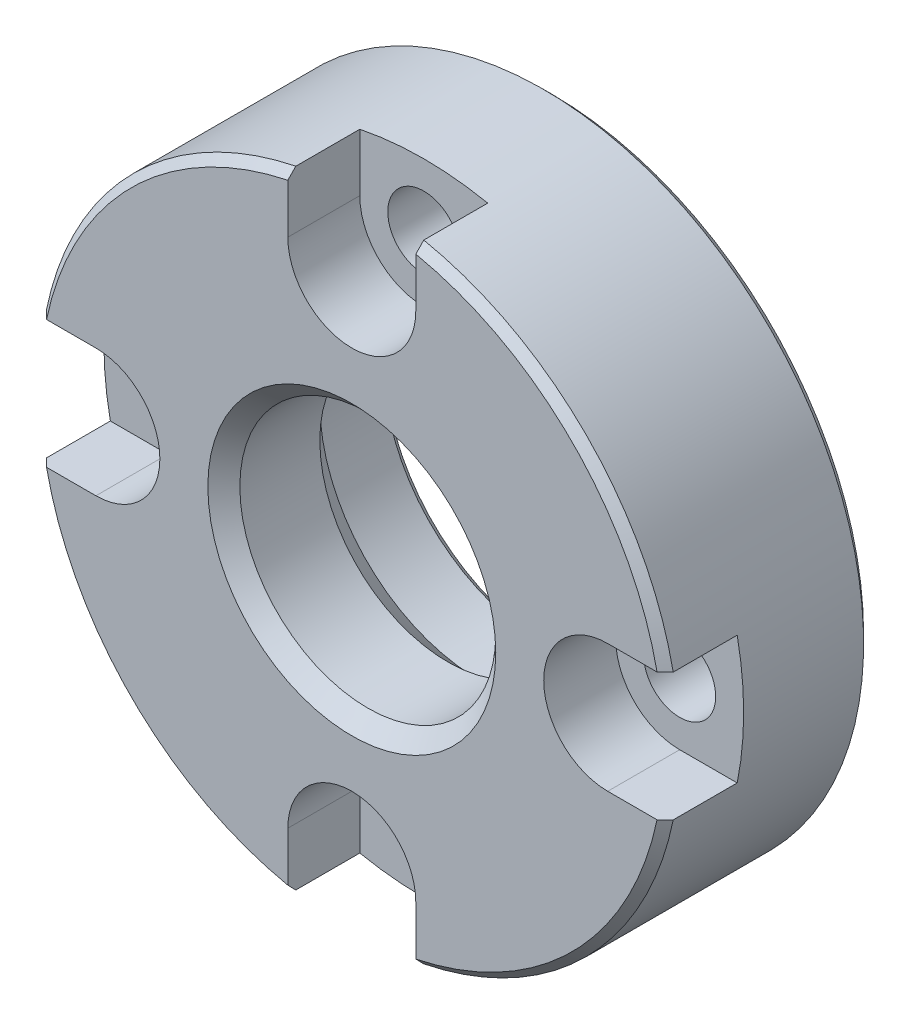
ISO-10303-21;
HEADER;
FILE_DESCRIPTION(('STEP AP214'),'2;1');
FILE_NAME('part.step','',(''),(''),'','','');
FILE_SCHEMA(('AUTOMOTIVE_DESIGN { 1 0 10303 214 1 1 1 1 }'));
ENDSEC;
DATA;
#1=APPLICATION_CONTEXT('core data for automotive mechanical design processes');
#2=APPLICATION_PROTOCOL_DEFINITION('international standard','automotive_design',2000,#1);
#3=PRODUCT_CONTEXT('',#1,'mechanical');
#4=PRODUCT('Part','Part','',(#3));
#5=PRODUCT_RELATED_PRODUCT_CATEGORY('part','',(#4));
#6=PRODUCT_DEFINITION_FORMATION('','',#4);
#7=PRODUCT_DEFINITION_CONTEXT('part definition',#1,'design');
#8=PRODUCT_DEFINITION('design','',#6,#7);
#9=PRODUCT_DEFINITION_SHAPE('','',#8);
#10=(LENGTH_UNIT() NAMED_UNIT(*) SI_UNIT(.MILLI.,.METRE.));
#11=(NAMED_UNIT(*) PLANE_ANGLE_UNIT() SI_UNIT($,.RADIAN.));
#12=(NAMED_UNIT(*) SI_UNIT($,.STERADIAN.) SOLID_ANGLE_UNIT());
#13=UNCERTAINTY_MEASURE_WITH_UNIT(LENGTH_MEASURE(1.E-05),#10,'distance_accuracy_value','');
#14=(GEOMETRIC_REPRESENTATION_CONTEXT(3) GLOBAL_UNCERTAINTY_ASSIGNED_CONTEXT((#13)) GLOBAL_UNIT_ASSIGNED_CONTEXT((#10,
#11,#12)) REPRESENTATION_CONTEXT('',''));
#15=CARTESIAN_POINT('',(0.,0.,0.));
#16=DIRECTION('',(0.,0.,1.));
#17=DIRECTION('',(1.,0.,0.));
#18=AXIS2_PLACEMENT_3D('',#15,#16,#17);
#19=CARTESIAN_POINT('',(-20.,0.,12.5));
#20=DIRECTION('',(0.,0.,1.));
#21=DIRECTION('',(1.,0.,0.));
#22=AXIS2_PLACEMENT_3D('',#19,#20,#21);
#23=PLANE('',#22);
#24=CARTESIAN_POINT('',(0.,0.,12.5));
#25=DIRECTION('',(0.,0.,1.));
#26=DIRECTION('',(1.,0.,0.));
#27=AXIS2_PLACEMENT_3D('',#24,#25,#26);
#28=CIRCLE('',#27,9.);
#29=CARTESIAN_POINT('',(9.,0.,12.5));
#30=VERTEX_POINT('',#29);
#31=EDGE_CURVE('E358',#30,#30,#28,.F.);
#32=ORIENTED_EDGE('',*,*,#31,.T.);
#33=EDGE_LOOP('',(#32));
#34=FACE_BOUND('',#33,.T.);
#35=DIRECTION('',(1.,0.,0.));
#36=VECTOR('',#35,1.);
#37=CARTESIAN_POINT('',(-16.,-4.,12.5));
#38=LINE('',#37,#36);
#39=CARTESIAN_POINT('',(-19.0853346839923,-4.,12.5));
#40=VERTEX_POINT('',#39);
#41=CARTESIAN_POINT('',(-16.,-4.,12.5));
#42=VERTEX_POINT('',#41);
#43=EDGE_CURVE('E260',#40,#42,#38,.T.);
#44=ORIENTED_EDGE('',*,*,#43,.F.);
#45=CARTESIAN_POINT('',(0.,0.,12.5));
#46=DIRECTION('',(0.,0.,1.));
#47=DIRECTION('',(1.,0.,0.));
#48=AXIS2_PLACEMENT_3D('',#45,#46,#47);
#49=CIRCLE('',#48,19.5);
#50=CARTESIAN_POINT('',(-3.99999999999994,-19.0853346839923,12.5));
#51=VERTEX_POINT('',#50);
#52=EDGE_CURVE('E517',#40,#51,#49,.T.);
#53=ORIENTED_EDGE('',*,*,#52,.T.);
#54=DIRECTION('',(0.,-1.,0.));
#55=VECTOR('',#54,1.);
#56=CARTESIAN_POINT('',(-3.99999999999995,-16.,12.5));
#57=LINE('',#56,#55);
#58=CARTESIAN_POINT('',(-3.99999999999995,-16.,12.5));
#59=VERTEX_POINT('',#58);
#60=EDGE_CURVE('E238',#59,#51,#57,.T.);
#61=ORIENTED_EDGE('',*,*,#60,.F.);
#62=CARTESIAN_POINT('',(0.,-16.,12.5));
#63=DIRECTION('',(0.,0.,1.));
#64=DIRECTION('',(0.,1.,0.));
#65=AXIS2_PLACEMENT_3D('',#62,#63,#64);
#66=CIRCLE('',#65,4.);
#67=CARTESIAN_POINT('',(4.00000000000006,-16.,12.5));
#68=VERTEX_POINT('',#67);
#69=EDGE_CURVE('E217',#68,#59,#66,.T.);
#70=ORIENTED_EDGE('',*,*,#69,.F.);
#71=DIRECTION('',(0.,1.,0.));
#72=VECTOR('',#71,1.);
#73=CARTESIAN_POINT('',(4.00000000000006,-16.,12.5));
#74=LINE('',#73,#72);
#75=CARTESIAN_POINT('',(4.00000000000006,-19.0853346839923,12.5));
#76=VERTEX_POINT('',#75);
#77=EDGE_CURVE('E228',#76,#68,#74,.T.);
#78=ORIENTED_EDGE('',*,*,#77,.F.);
#79=CARTESIAN_POINT('',(0.,0.,12.5));
#80=DIRECTION('',(0.,0.,1.));
#81=DIRECTION('',(1.,0.,0.));
#82=AXIS2_PLACEMENT_3D('',#79,#80,#81);
#83=CIRCLE('',#82,19.5);
#84=CARTESIAN_POINT('',(19.0853346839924,-3.99999999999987,12.5));
#85=VERTEX_POINT('',#84);
#86=EDGE_CURVE('E511',#76,#85,#83,.T.);
#87=ORIENTED_EDGE('',*,*,#86,.T.);
#88=DIRECTION('',(1.,0.,0.));
#89=VECTOR('',#88,1.);
#90=CARTESIAN_POINT('',(16.,-3.99999999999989,12.5));
#91=LINE('',#90,#89);
#92=CARTESIAN_POINT('',(16.,-3.99999999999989,12.5));
#93=VERTEX_POINT('',#92);
#94=EDGE_CURVE('E210',#93,#85,#91,.T.);
#95=ORIENTED_EDGE('',*,*,#94,.F.);
#96=CARTESIAN_POINT('',(16.,1.13686837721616E-13,12.5));
#97=DIRECTION('',(0.,0.,1.));
#98=DIRECTION('',(-1.,0.,0.));
#99=AXIS2_PLACEMENT_3D('',#96,#97,#98);
#100=CIRCLE('',#99,4.);
#101=CARTESIAN_POINT('',(16.,4.00000000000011,12.5));
#102=VERTEX_POINT('',#101);
#103=EDGE_CURVE('E191',#102,#93,#100,.T.);
#104=ORIENTED_EDGE('',*,*,#103,.F.);
#105=DIRECTION('',(-1.,0.,0.));
#106=VECTOR('',#105,1.);
#107=CARTESIAN_POINT('',(16.,4.00000000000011,12.5));
#108=LINE('',#107,#106);
#109=CARTESIAN_POINT('',(19.0853346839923,4.00000000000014,12.5));
#110=VERTEX_POINT('',#109);
#111=EDGE_CURVE('E200',#110,#102,#108,.T.);
#112=ORIENTED_EDGE('',*,*,#111,.F.);
#113=CARTESIAN_POINT('',(0.,0.,12.5));
#114=DIRECTION('',(0.,0.,1.));
#115=DIRECTION('',(1.,0.,0.));
#116=AXIS2_PLACEMENT_3D('',#113,#114,#115);
#117=CIRCLE('',#116,19.5);
#118=CARTESIAN_POINT('',(3.9999999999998,19.0853346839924,12.5));
#119=VERTEX_POINT('',#118);
#120=EDGE_CURVE('E31',#110,#119,#117,.T.);
#121=ORIENTED_EDGE('',*,*,#120,.T.);
#122=DIRECTION('',(0.,1.,0.));
#123=VECTOR('',#122,1.);
#124=CARTESIAN_POINT('',(3.99999999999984,16.,12.5));
#125=LINE('',#124,#123);
#126=CARTESIAN_POINT('',(3.99999999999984,16.,12.5));
#127=VERTEX_POINT('',#126);
#128=EDGE_CURVE('E179',#127,#119,#125,.T.);
#129=ORIENTED_EDGE('',*,*,#128,.F.);
#130=CARTESIAN_POINT('',(-1.69550539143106E-13,16.,12.5));
#131=DIRECTION('',(0.,0.,1.));
#132=DIRECTION('',(0.,-1.,0.));
#133=AXIS2_PLACEMENT_3D('',#130,#131,#132);
#134=CIRCLE('',#133,4.);
#135=CARTESIAN_POINT('',(-4.00000000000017,16.,12.5));
#136=VERTEX_POINT('',#135);
#137=EDGE_CURVE('E162',#136,#127,#134,.T.);
#138=ORIENTED_EDGE('',*,*,#137,.F.);
#139=DIRECTION('',(0.,-1.,0.));
#140=VECTOR('',#139,1.);
#141=CARTESIAN_POINT('',(-4.00000000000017,16.,12.5));
#142=LINE('',#141,#140);
#143=CARTESIAN_POINT('',(-4.0000000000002,19.0853346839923,12.5));
#144=VERTEX_POINT('',#143);
#145=EDGE_CURVE('E177',#144,#136,#142,.T.);
#146=ORIENTED_EDGE('',*,*,#145,.F.);
#147=CARTESIAN_POINT('',(0.,0.,12.5));
#148=DIRECTION('',(0.,0.,1.));
#149=DIRECTION('',(1.,0.,0.));
#150=AXIS2_PLACEMENT_3D('',#147,#148,#149);
#151=CIRCLE('',#150,19.5);
#152=CARTESIAN_POINT('',(-19.0853346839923,4.,12.5));
#153=VERTEX_POINT('',#152);
#154=EDGE_CURVE('E328',#144,#153,#151,.T.);
#155=ORIENTED_EDGE('',*,*,#154,.T.);
#156=DIRECTION('',(-1.,0.,0.));
#157=VECTOR('',#156,1.);
#158=CARTESIAN_POINT('',(-16.,4.,12.5));
#159=LINE('',#158,#157);
#160=CARTESIAN_POINT('',(-16.,4.,12.5));
#161=VERTEX_POINT('',#160);
#162=EDGE_CURVE('E270',#161,#153,#159,.T.);
#163=ORIENTED_EDGE('',*,*,#162,.F.);
#164=CARTESIAN_POINT('',(-16.,0.,12.5));
#165=DIRECTION('',(0.,0.,1.));
#166=DIRECTION('',(1.,0.,0.));
#167=AXIS2_PLACEMENT_3D('',#164,#165,#166);
#168=CIRCLE('',#167,4.);
#169=EDGE_CURVE('E255',#42,#161,#168,.T.);
#170=ORIENTED_EDGE('',*,*,#169,.F.);
#171=EDGE_LOOP('',(#44,#53,#61,#70,#78,#87,#95,#104,#112,#121,#129,#138,#146,#155,#163,#170));
#172=FACE_BOUND('',#171,.T.);
#173=ADVANCED_FACE('F16',(#34,#172),#23,.T.);
#174=CARTESIAN_POINT('',(0.,0.,0.));
#175=DIRECTION('',(0.,0.,-1.));
#176=DIRECTION('',(-1.,0.,0.));
#177=AXIS2_PLACEMENT_3D('',#174,#175,#176);
#178=CYLINDRICAL_SURFACE('',#177,20.);
#179=CARTESIAN_POINT('',(0.,0.,0.500000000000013));
#180=DIRECTION('',(0.,0.,-1.));
#181=DIRECTION('',(-1.,0.,0.));
#182=AXIS2_PLACEMENT_3D('',#179,#180,#181);
#183=CIRCLE('',#182,20.);
#184=CARTESIAN_POINT('',(-20.,0.,0.500000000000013));
#185=VERTEX_POINT('',#184);
#186=EDGE_CURVE('E10',#185,#185,#183,.F.);
#187=ORIENTED_EDGE('',*,*,#186,.T.);
#188=EDGE_LOOP('',(#187));
#189=FACE_BOUND('',#188,.T.);
#190=DIRECTION('',(0.,0.,1.));
#191=VECTOR('',#190,1.);
#192=CARTESIAN_POINT('',(-3.99999999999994,-19.5959179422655,8.));
#193=LINE('',#192,#191);
#194=CARTESIAN_POINT('',(-3.99999999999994,-19.5959179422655,8.));
#195=VERTEX_POINT('',#194);
#196=CARTESIAN_POINT('',(-3.99999999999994,-19.5959179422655,12.));
#197=VERTEX_POINT('',#196);
#198=EDGE_CURVE('E249',#195,#197,#193,.T.);
#199=ORIENTED_EDGE('',*,*,#198,.T.);
#200=CARTESIAN_POINT('',(0.,0.,12.));
#201=DIRECTION('',(0.,0.,1.));
#202=DIRECTION('',(1.,0.,0.));
#203=AXIS2_PLACEMENT_3D('',#200,#201,#202);
#204=CIRCLE('',#203,20.);
#205=CARTESIAN_POINT('',(-19.5959179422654,-4.,12.));
#206=VERTEX_POINT('',#205);
#207=EDGE_CURVE('E317',#197,#206,#204,.F.);
#208=ORIENTED_EDGE('',*,*,#207,.T.);
#209=DIRECTION('',(0.,0.,1.));
#210=VECTOR('',#209,1.);
#211=CARTESIAN_POINT('',(-19.5959179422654,-4.,8.));
#212=LINE('',#211,#210);
#213=CARTESIAN_POINT('',(-19.5959179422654,-4.,8.));
#214=VERTEX_POINT('',#213);
#215=EDGE_CURVE('E278',#214,#206,#212,.T.);
#216=ORIENTED_EDGE('',*,*,#215,.F.);
#217=CARTESIAN_POINT('',(0.,0.,8.));
#218=DIRECTION('',(0.,0.,1.));
#219=DIRECTION('',(1.,0.,0.));
#220=AXIS2_PLACEMENT_3D('',#217,#218,#219);
#221=CIRCLE('',#220,20.);
#222=CARTESIAN_POINT('',(-19.5959179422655,4.,8.));
#223=VERTEX_POINT('',#222);
#224=EDGE_CURVE('E262',#223,#214,#221,.T.);
#225=ORIENTED_EDGE('',*,*,#224,.F.);
#226=DIRECTION('',(0.,0.,1.));
#227=VECTOR('',#226,1.);
#228=CARTESIAN_POINT('',(-19.5959179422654,4.,8.));
#229=LINE('',#228,#227);
#230=CARTESIAN_POINT('',(-19.5959179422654,4.,12.));
#231=VERTEX_POINT('',#230);
#232=EDGE_CURVE('E281',#223,#231,#229,.T.);
#233=ORIENTED_EDGE('',*,*,#232,.T.);
#234=CARTESIAN_POINT('',(0.,0.,12.));
#235=DIRECTION('',(0.,0.,1.));
#236=DIRECTION('',(1.,0.,0.));
#237=AXIS2_PLACEMENT_3D('',#234,#235,#236);
#238=CIRCLE('',#237,20.);
#239=CARTESIAN_POINT('',(-4.00000000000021,19.5959179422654,12.));
#240=VERTEX_POINT('',#239);
#241=EDGE_CURVE('E308',#231,#240,#238,.F.);
#242=ORIENTED_EDGE('',*,*,#241,.T.);
#243=DIRECTION('',(0.,0.,1.));
#244=VECTOR('',#243,1.);
#245=CARTESIAN_POINT('',(-4.00000000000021,19.5959179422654,8.));
#246=LINE('',#245,#244);
#247=CARTESIAN_POINT('',(-4.00000000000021,19.5959179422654,8.));
#248=VERTEX_POINT('',#247);
#249=EDGE_CURVE('E192',#248,#240,#246,.T.);
#250=ORIENTED_EDGE('',*,*,#249,.F.);
#251=CARTESIAN_POINT('',(0.,0.,8.));
#252=DIRECTION('',(0.,0.,1.));
#253=DIRECTION('',(0.,-1.,0.));
#254=AXIS2_PLACEMENT_3D('',#251,#252,#253);
#255=CIRCLE('',#254,20.);
#256=CARTESIAN_POINT('',(3.9999999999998,19.5959179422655,8.));
#257=VERTEX_POINT('',#256);
#258=EDGE_CURVE('E173',#257,#248,#255,.T.);
#259=ORIENTED_EDGE('',*,*,#258,.F.);
#260=DIRECTION('',(0.,0.,1.));
#261=VECTOR('',#260,1.);
#262=CARTESIAN_POINT('',(3.9999999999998,19.5959179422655,8.));
#263=LINE('',#262,#261);
#264=CARTESIAN_POINT('',(3.9999999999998,19.5959179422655,12.));
#265=VERTEX_POINT('',#264);
#266=EDGE_CURVE('E164',#257,#265,#263,.T.);
#267=ORIENTED_EDGE('',*,*,#266,.T.);
#268=CARTESIAN_POINT('',(0.,0.,12.));
#269=DIRECTION('',(0.,0.,1.));
#270=DIRECTION('',(1.,0.,0.));
#271=AXIS2_PLACEMENT_3D('',#268,#269,#270);
#272=CIRCLE('',#271,20.);
#273=CARTESIAN_POINT('',(19.5959179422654,4.00000000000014,12.));
#274=VERTEX_POINT('',#273);
#275=EDGE_CURVE('E311',#265,#274,#272,.F.);
#276=ORIENTED_EDGE('',*,*,#275,.T.);
#277=DIRECTION('',(0.,0.,1.));
#278=VECTOR('',#277,1.);
#279=CARTESIAN_POINT('',(19.5959179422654,4.00000000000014,8.));
#280=LINE('',#279,#278);
#281=CARTESIAN_POINT('',(19.5959179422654,4.00000000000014,8.));
#282=VERTEX_POINT('',#281);
#283=EDGE_CURVE('E218',#282,#274,#280,.T.);
#284=ORIENTED_EDGE('',*,*,#283,.F.);
#285=CARTESIAN_POINT('',(0.,0.,8.));
#286=DIRECTION('',(0.,0.,1.));
#287=DIRECTION('',(-1.,0.,0.));
#288=AXIS2_PLACEMENT_3D('',#285,#286,#287);
#289=CIRCLE('',#288,20.);
#290=CARTESIAN_POINT('',(19.5959179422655,-3.99999999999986,8.));
#291=VERTEX_POINT('',#290);
#292=EDGE_CURVE('E202',#291,#282,#289,.T.);
#293=ORIENTED_EDGE('',*,*,#292,.F.);
#294=DIRECTION('',(0.,0.,1.));
#295=VECTOR('',#294,1.);
#296=CARTESIAN_POINT('',(19.5959179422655,-3.99999999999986,8.));
#297=LINE('',#296,#295);
#298=CARTESIAN_POINT('',(19.5959179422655,-3.99999999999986,12.));
#299=VERTEX_POINT('',#298);
#300=EDGE_CURVE('E220',#291,#299,#297,.T.);
#301=ORIENTED_EDGE('',*,*,#300,.T.);
#302=CARTESIAN_POINT('',(0.,0.,12.));
#303=DIRECTION('',(0.,0.,1.));
#304=DIRECTION('',(1.,0.,0.));
#305=AXIS2_PLACEMENT_3D('',#302,#303,#304);
#306=CIRCLE('',#305,20.);
#307=CARTESIAN_POINT('',(4.00000000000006,-19.5959179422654,12.));
#308=VERTEX_POINT('',#307);
#309=EDGE_CURVE('E314',#299,#308,#306,.F.);
#310=ORIENTED_EDGE('',*,*,#309,.T.);
#311=DIRECTION('',(0.,0.,1.));
#312=VECTOR('',#311,1.);
#313=CARTESIAN_POINT('',(4.00000000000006,-19.5959179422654,8.));
#314=LINE('',#313,#312);
#315=CARTESIAN_POINT('',(4.00000000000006,-19.5959179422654,8.));
#316=VERTEX_POINT('',#315);
#317=EDGE_CURVE('E246',#316,#308,#314,.T.);
#318=ORIENTED_EDGE('',*,*,#317,.F.);
#319=CARTESIAN_POINT('',(0.,0.,8.));
#320=DIRECTION('',(0.,0.,1.));
#321=DIRECTION('',(0.,1.,0.));
#322=AXIS2_PLACEMENT_3D('',#319,#320,#321);
#323=CIRCLE('',#322,20.);
#324=EDGE_CURVE('E230',#195,#316,#323,.T.);
#325=ORIENTED_EDGE('',*,*,#324,.F.);
#326=EDGE_LOOP('',(#199,#208,#216,#225,#233,#242,#250,#259,#267,#276,#284,#293,#301,#310,#318,#325));
#327=FACE_BOUND('',#326,.T.);
#328=ADVANCED_FACE('F393',(#189,#327),#178,.T.);
#329=CARTESIAN_POINT('',(-20.,0.,0.));
#330=DIRECTION('',(0.,0.,-1.));
#331=DIRECTION('',(-1.,0.,0.));
#332=AXIS2_PLACEMENT_3D('',#329,#330,#331);
#333=PLANE('',#332);
#334=CARTESIAN_POINT('',(0.,0.,0.));
#335=DIRECTION('',(0.,0.,-1.));
#336=DIRECTION('',(-1.,0.,0.));
#337=AXIS2_PLACEMENT_3D('',#334,#335,#336);
#338=CIRCLE('',#337,19.5);
#339=CARTESIAN_POINT('',(-19.5,0.,0.));
#340=VERTEX_POINT('',#339);
#341=EDGE_CURVE('E24',#340,#340,#338,.T.);
#342=ORIENTED_EDGE('',*,*,#341,.T.);
#343=EDGE_LOOP('',(#342));
#344=FACE_BOUND('',#343,.T.);
#345=CARTESIAN_POINT('',(0.,0.,0.));
#346=DIRECTION('',(0.,0.,-1.));
#347=DIRECTION('',(-1.,0.,0.));
#348=AXIS2_PLACEMENT_3D('',#345,#346,#347);
#349=CIRCLE('',#348,10.5);
#350=CARTESIAN_POINT('',(-10.5,0.,0.));
#351=VERTEX_POINT('',#350);
#352=EDGE_CURVE('E453',#351,#351,#349,.F.);
#353=ORIENTED_EDGE('',*,*,#352,.T.);
#354=EDGE_LOOP('',(#353));
#355=FACE_BOUND('',#354,.T.);
#356=CARTESIAN_POINT('',(-1.69550539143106E-13,16.,0.));
#357=DIRECTION('',(0.,0.,-1.));
#358=DIRECTION('',(-1.,0.,0.));
#359=AXIS2_PLACEMENT_3D('',#356,#357,#358);
#360=CIRCLE('',#359,2.75);
#361=CARTESIAN_POINT('',(-2.75000000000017,16.,0.));
#362=VERTEX_POINT('',#361);
#363=EDGE_CURVE('E302',#362,#362,#360,.F.);
#364=ORIENTED_EDGE('',*,*,#363,.T.);
#365=EDGE_LOOP('',(#364));
#366=FACE_BOUND('',#365,.T.);
#367=CARTESIAN_POINT('',(16.,1.13686837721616E-13,0.));
#368=DIRECTION('',(0.,0.,-1.));
#369=DIRECTION('',(-1.,0.,0.));
#370=AXIS2_PLACEMENT_3D('',#367,#368,#369);
#371=CIRCLE('',#370,2.75);
#372=CARTESIAN_POINT('',(13.25,1.13686837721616E-13,0.));
#373=VERTEX_POINT('',#372);
#374=EDGE_CURVE('E296',#373,#373,#371,.F.);
#375=ORIENTED_EDGE('',*,*,#374,.T.);
#376=EDGE_LOOP('',(#375));
#377=FACE_BOUND('',#376,.T.);
#378=CARTESIAN_POINT('',(0.,-16.,0.));
#379=DIRECTION('',(0.,0.,-1.));
#380=DIRECTION('',(-1.,0.,0.));
#381=AXIS2_PLACEMENT_3D('',#378,#379,#380);
#382=CIRCLE('',#381,2.75);
#383=CARTESIAN_POINT('',(-2.74999999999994,-16.,0.));
#384=VERTEX_POINT('',#383);
#385=EDGE_CURVE('E290',#384,#384,#382,.F.);
#386=ORIENTED_EDGE('',*,*,#385,.T.);
#387=EDGE_LOOP('',(#386));
#388=FACE_BOUND('',#387,.T.);
#389=CARTESIAN_POINT('',(-16.,0.,0.));
#390=DIRECTION('',(0.,0.,-1.));
#391=DIRECTION('',(-1.,0.,0.));
#392=AXIS2_PLACEMENT_3D('',#389,#390,#391);
#393=CIRCLE('',#392,2.75);
#394=CARTESIAN_POINT('',(-18.75,0.,0.));
#395=VERTEX_POINT('',#394);
#396=EDGE_CURVE('E277',#395,#395,#393,.F.);
#397=ORIENTED_EDGE('',*,*,#396,.T.);
#398=EDGE_LOOP('',(#397));
#399=FACE_BOUND('',#398,.T.);
#400=ADVANCED_FACE('F400',(#344,#355,#366,#377,#388,#399),#333,.T.);
#401=CARTESIAN_POINT('',(-16.,0.,8.));
#402=DIRECTION('',(0.,0.,1.));
#403=DIRECTION('',(1.,0.,0.));
#404=AXIS2_PLACEMENT_3D('',#401,#402,#403);
#405=CYLINDRICAL_SURFACE('',#404,4.);
#406=ORIENTED_EDGE('',*,*,#169,.T.);
#407=DIRECTION('',(0.,0.,1.));
#408=VECTOR('',#407,1.);
#409=CARTESIAN_POINT('',(-16.,4.,8.));
#410=LINE('',#409,#408);
#411=CARTESIAN_POINT('',(-16.,4.,8.));
#412=VERTEX_POINT('',#411);
#413=EDGE_CURVE('E267',#412,#161,#410,.T.);
#414=ORIENTED_EDGE('',*,*,#413,.F.);
#415=CARTESIAN_POINT('',(-16.,0.,8.));
#416=DIRECTION('',(0.,0.,1.));
#417=DIRECTION('',(1.,0.,0.));
#418=AXIS2_PLACEMENT_3D('',#415,#416,#417);
#419=CIRCLE('',#418,4.);
#420=CARTESIAN_POINT('',(-16.,-4.,8.));
#421=VERTEX_POINT('',#420);
#422=EDGE_CURVE('E256',#421,#412,#419,.T.);
#423=ORIENTED_EDGE('',*,*,#422,.F.);
#424=DIRECTION('',(0.,0.,1.));
#425=VECTOR('',#424,1.);
#426=CARTESIAN_POINT('',(-16.,-4.,8.));
#427=LINE('',#426,#425);
#428=EDGE_CURVE('E274',#421,#42,#427,.T.);
#429=ORIENTED_EDGE('',*,*,#428,.T.);
#430=EDGE_LOOP('',(#406,#414,#423,#429));
#431=FACE_BOUND('',#430,.T.);
#432=ADVANCED_FACE('F340',(#431),#405,.F.);
#433=CARTESIAN_POINT('',(-16.,-4.,8.));
#434=DIRECTION('',(0.,-1.,0.));
#435=DIRECTION('',(1.,0.,0.));
#436=AXIS2_PLACEMENT_3D('',#433,#434,#435);
#437=PLANE('',#436);
#438=ORIENTED_EDGE('',*,*,#215,.T.);
#439=CARTESIAN_POINT('',(-19.5959179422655,-4.,12.));
#440=CARTESIAN_POINT('',(-19.5108432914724,-4.,12.0833563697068));
#441=CARTESIAN_POINT('',(-19.4257573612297,-4.,12.1667012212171));
#442=CARTESIAN_POINT('',(-19.2555629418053,-4.,12.3333678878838));
#443=CARTESIAN_POINT('',(-19.1704544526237,-4.,12.4166897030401));
#444=CARTESIAN_POINT('',(-19.0853346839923,-4.,12.5));
#445=B_SPLINE_CURVE_WITH_KNOTS('',3,(#439,#440,#441,#442,#443,#444),.UNSPECIFIED.,.F.,.F.,(4,2,
4),(0.,0.357314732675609,0.71462946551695),.UNSPECIFIED.);
#446=EDGE_CURVE('E320',#206,#40,#445,.T.);
#447=ORIENTED_EDGE('',*,*,#446,.T.);
#448=ORIENTED_EDGE('',*,*,#43,.T.);
#449=ORIENTED_EDGE('',*,*,#428,.F.);
#450=DIRECTION('',(1.,0.,0.));
#451=VECTOR('',#450,1.);
#452=CARTESIAN_POINT('',(-16.,-4.,8.));
#453=LINE('',#452,#451);
#454=EDGE_CURVE('E264',#214,#421,#453,.T.);
#455=ORIENTED_EDGE('',*,*,#454,.F.);
#456=EDGE_LOOP('',(#438,#447,#448,#449,#455));
#457=FACE_BOUND('',#456,.T.);
#458=ADVANCED_FACE('F334',(#457),#437,.F.);
#459=CARTESIAN_POINT('',(-16.,4.,8.));
#460=DIRECTION('',(0.,1.,0.));
#461=DIRECTION('',(-1.,0.,0.));
#462=AXIS2_PLACEMENT_3D('',#459,#460,#461);
#463=PLANE('',#462);
#464=ORIENTED_EDGE('',*,*,#162,.T.);
#465=CARTESIAN_POINT('',(-19.0853346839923,4.,12.5));
#466=CARTESIAN_POINT('',(-19.1704544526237,4.,12.4166897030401));
#467=CARTESIAN_POINT('',(-19.2555629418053,4.,12.3333678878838));
#468=CARTESIAN_POINT('',(-19.4257573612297,4.,12.1667012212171));
#469=CARTESIAN_POINT('',(-19.5108432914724,4.,12.0833563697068));
#470=CARTESIAN_POINT('',(-19.5959179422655,4.,12.));
#471=B_SPLINE_CURVE_WITH_KNOTS('',3,(#465,#466,#467,#468,#469,#470),.UNSPECIFIED.,.F.,.F.,(4,2,
4),(0.,0.35731473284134,0.71462946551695),.UNSPECIFIED.);
#472=EDGE_CURVE('E350',#153,#231,#471,.T.);
#473=ORIENTED_EDGE('',*,*,#472,.T.);
#474=ORIENTED_EDGE('',*,*,#232,.F.);
#475=DIRECTION('',(-1.,0.,0.));
#476=VECTOR('',#475,1.);
#477=CARTESIAN_POINT('',(-16.,4.,8.));
#478=LINE('',#477,#476);
#479=EDGE_CURVE('E259',#412,#223,#478,.T.);
#480=ORIENTED_EDGE('',*,*,#479,.F.);
#481=ORIENTED_EDGE('',*,*,#413,.T.);
#482=EDGE_LOOP('',(#464,#473,#474,#480,#481));
#483=FACE_BOUND('',#482,.T.);
#484=ADVANCED_FACE('F339',(#483),#463,.F.);
#485=CARTESIAN_POINT('',(-16.,0.,8.));
#486=DIRECTION('',(0.,0.,1.));
#487=DIRECTION('',(1.,0.,0.));
#488=AXIS2_PLACEMENT_3D('',#485,#486,#487);
#489=PLANE('',#488);
#490=CARTESIAN_POINT('',(-16.,0.,8.));
#491=DIRECTION('',(0.,0.,1.));
#492=DIRECTION('',(1.,0.,0.));
#493=AXIS2_PLACEMENT_3D('',#490,#491,#492);
#494=CIRCLE('',#493,2.25);
#495=CARTESIAN_POINT('',(-13.75,0.,8.));
#496=VERTEX_POINT('',#495);
#497=EDGE_CURVE('E245',#496,#496,#494,.T.);
#498=ORIENTED_EDGE('',*,*,#497,.F.);
#499=EDGE_LOOP('',(#498));
#500=FACE_BOUND('',#499,.T.);
#501=ORIENTED_EDGE('',*,*,#422,.T.);
#502=ORIENTED_EDGE('',*,*,#479,.T.);
#503=ORIENTED_EDGE('',*,*,#224,.T.);
#504=ORIENTED_EDGE('',*,*,#454,.T.);
#505=EDGE_LOOP('',(#501,#502,#503,#504));
#506=FACE_BOUND('',#505,.T.);
#507=ADVANCED_FACE('F342',(#500,#506),#489,.T.);
#508=CARTESIAN_POINT('',(-16.,0.,0.));
#509=DIRECTION('',(0.,0.,1.));
#510=DIRECTION('',(1.,0.,0.));
#511=AXIS2_PLACEMENT_3D('',#508,#509,#510);
#512=CYLINDRICAL_SURFACE('',#511,2.25);
#513=CARTESIAN_POINT('',(-16.,0.,0.5));
#514=DIRECTION('',(0.,0.,-1.));
#515=DIRECTION('',(-1.,0.,0.));
#516=AXIS2_PLACEMENT_3D('',#513,#514,#515);
#517=CIRCLE('',#516,2.25);
#518=CARTESIAN_POINT('',(-18.25,0.,0.5));
#519=VERTEX_POINT('',#518);
#520=EDGE_CURVE('E287',#519,#519,#517,.T.);
#521=ORIENTED_EDGE('',*,*,#520,.T.);
#522=EDGE_LOOP('',(#521));
#523=FACE_BOUND('',#522,.T.);
#524=ORIENTED_EDGE('',*,*,#497,.T.);
#525=EDGE_LOOP('',(#524));
#526=FACE_BOUND('',#525,.T.);
#527=ADVANCED_FACE('F409',(#523,#526),#512,.F.);
#528=CARTESIAN_POINT('',(-16.,0.,0.));
#529=DIRECTION('',(0.,0.,-1.));
#530=DIRECTION('',(-1.,0.,0.));
#531=AXIS2_PLACEMENT_3D('',#528,#529,#530);
#532=CONICAL_SURFACE('',#531,2.75,0.785398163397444);
#533=ORIENTED_EDGE('',*,*,#520,.F.);
#534=EDGE_LOOP('',(#533));
#535=FACE_BOUND('',#534,.T.);
#536=ORIENTED_EDGE('',*,*,#396,.F.);
#537=EDGE_LOOP('',(#536));
#538=FACE_BOUND('',#537,.T.);
#539=ADVANCED_FACE('F405',(#535,#538),#532,.F.);
#540=CARTESIAN_POINT('',(0.,-16.,8.));
#541=DIRECTION('',(0.,0.,1.));
#542=DIRECTION('',(1.,0.,0.));
#543=AXIS2_PLACEMENT_3D('',#540,#541,#542);
#544=CYLINDRICAL_SURFACE('',#543,4.);
#545=ORIENTED_EDGE('',*,*,#69,.T.);
#546=DIRECTION('',(0.,0.,1.));
#547=VECTOR('',#546,1.);
#548=CARTESIAN_POINT('',(-3.99999999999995,-16.,8.));
#549=LINE('',#548,#547);
#550=CARTESIAN_POINT('',(-3.99999999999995,-16.,8.));
#551=VERTEX_POINT('',#550);
#552=EDGE_CURVE('E235',#551,#59,#549,.T.);
#553=ORIENTED_EDGE('',*,*,#552,.F.);
#554=CARTESIAN_POINT('',(0.,-16.,8.));
#555=DIRECTION('',(0.,0.,1.));
#556=DIRECTION('',(0.,1.,0.));
#557=AXIS2_PLACEMENT_3D('',#554,#555,#556);
#558=CIRCLE('',#557,4.);
#559=CARTESIAN_POINT('',(4.00000000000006,-16.,8.));
#560=VERTEX_POINT('',#559);
#561=EDGE_CURVE('E224',#560,#551,#558,.T.);
#562=ORIENTED_EDGE('',*,*,#561,.F.);
#563=DIRECTION('',(0.,0.,1.));
#564=VECTOR('',#563,1.);
#565=CARTESIAN_POINT('',(4.00000000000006,-16.,8.));
#566=LINE('',#565,#564);
#567=EDGE_CURVE('E242',#560,#68,#566,.T.);
#568=ORIENTED_EDGE('',*,*,#567,.T.);
#569=EDGE_LOOP('',(#545,#553,#562,#568));
#570=FACE_BOUND('',#569,.T.);
#571=ADVANCED_FACE('F408',(#570),#544,.F.);
#572=CARTESIAN_POINT('',(4.00000000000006,-16.,8.));
#573=DIRECTION('',(1.,0.,0.));
#574=DIRECTION('',(0.,1.,0.));
#575=AXIS2_PLACEMENT_3D('',#572,#573,#574);
#576=PLANE('',#575);
#577=ORIENTED_EDGE('',*,*,#317,.T.);
#578=CARTESIAN_POINT('',(4.00000000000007,-19.5959179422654,12.));
#579=CARTESIAN_POINT('',(4.00000000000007,-19.5108432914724,12.0833563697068));
#580=CARTESIAN_POINT('',(4.00000000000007,-19.4257573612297,12.1667012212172));
#581=CARTESIAN_POINT('',(4.00000000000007,-19.2555629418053,12.3333678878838));
#582=CARTESIAN_POINT('',(4.00000000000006,-19.1704544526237,12.4166897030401));
#583=CARTESIAN_POINT('',(4.00000000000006,-19.0853346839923,12.5));
#584=B_SPLINE_CURVE_WITH_KNOTS('',3,(#578,#579,#580,#581,#582,#583),.UNSPECIFIED.,.F.,.F.,(4,2,
4),(0.,0.357314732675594,0.714629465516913),.UNSPECIFIED.);
#585=EDGE_CURVE('E507',#308,#76,#584,.T.);
#586=ORIENTED_EDGE('',*,*,#585,.T.);
#587=ORIENTED_EDGE('',*,*,#77,.T.);
#588=ORIENTED_EDGE('',*,*,#567,.F.);
#589=DIRECTION('',(0.,1.,0.));
#590=VECTOR('',#589,1.);
#591=CARTESIAN_POINT('',(4.00000000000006,-16.,8.));
#592=LINE('',#591,#590);
#593=EDGE_CURVE('E232',#316,#560,#592,.T.);
#594=ORIENTED_EDGE('',*,*,#593,.F.);
#595=EDGE_LOOP('',(#577,#586,#587,#588,#594));
#596=FACE_BOUND('',#595,.T.);
#597=ADVANCED_FACE('F505',(#596),#576,.F.);
#598=CARTESIAN_POINT('',(-3.99999999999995,-16.,8.));
#599=DIRECTION('',(-1.,0.,0.));
#600=DIRECTION('',(0.,-1.,0.));
#601=AXIS2_PLACEMENT_3D('',#598,#599,#600);
#602=PLANE('',#601);
#603=ORIENTED_EDGE('',*,*,#60,.T.);
#604=CARTESIAN_POINT('',(-3.99999999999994,-19.0853346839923,12.5));
#605=CARTESIAN_POINT('',(-3.99999999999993,-19.1704544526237,12.4166897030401));
#606=CARTESIAN_POINT('',(-3.99999999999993,-19.2555629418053,12.3333678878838));
#607=CARTESIAN_POINT('',(-3.99999999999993,-19.4257573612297,12.1667012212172));
#608=CARTESIAN_POINT('',(-3.99999999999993,-19.5108432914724,12.0833563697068));
#609=CARTESIAN_POINT('',(-3.99999999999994,-19.5959179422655,12.));
#610=B_SPLINE_CURVE_WITH_KNOTS('',3,(#604,#605,#606,#607,#608,#609),.UNSPECIFIED.,.F.,.F.,(4,2,
4),(0.,0.35731473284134,0.71462946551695),.UNSPECIFIED.);
#611=EDGE_CURVE('E500',#51,#197,#610,.T.);
#612=ORIENTED_EDGE('',*,*,#611,.T.);
#613=ORIENTED_EDGE('',*,*,#198,.F.);
#614=DIRECTION('',(0.,-1.,0.));
#615=VECTOR('',#614,1.);
#616=CARTESIAN_POINT('',(-3.99999999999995,-16.,8.));
#617=LINE('',#616,#615);
#618=EDGE_CURVE('E227',#551,#195,#617,.T.);
#619=ORIENTED_EDGE('',*,*,#618,.F.);
#620=ORIENTED_EDGE('',*,*,#552,.T.);
#621=EDGE_LOOP('',(#603,#612,#613,#619,#620));
#622=FACE_BOUND('',#621,.T.);
#623=ADVANCED_FACE('F488',(#622),#602,.F.);
#624=CARTESIAN_POINT('',(0.,-16.,8.));
#625=DIRECTION('',(0.,0.,1.));
#626=DIRECTION('',(0.,1.,0.));
#627=AXIS2_PLACEMENT_3D('',#624,#625,#626);
#628=PLANE('',#627);
#629=CARTESIAN_POINT('',(0.,-16.,8.));
#630=DIRECTION('',(0.,0.,1.));
#631=DIRECTION('',(0.,1.,0.));
#632=AXIS2_PLACEMENT_3D('',#629,#630,#631);
#633=CIRCLE('',#632,2.25);
#634=CARTESIAN_POINT('',(0.,-13.75,8.));
#635=VERTEX_POINT('',#634);
#636=EDGE_CURVE('E182',#635,#635,#633,.T.);
#637=ORIENTED_EDGE('',*,*,#636,.F.);
#638=EDGE_LOOP('',(#637));
#639=FACE_BOUND('',#638,.T.);
#640=ORIENTED_EDGE('',*,*,#561,.T.);
#641=ORIENTED_EDGE('',*,*,#618,.T.);
#642=ORIENTED_EDGE('',*,*,#324,.T.);
#643=ORIENTED_EDGE('',*,*,#593,.T.);
#644=EDGE_LOOP('',(#640,#641,#642,#643));
#645=FACE_BOUND('',#644,.T.);
#646=ADVANCED_FACE('F484',(#639,#645),#628,.T.);
#647=CARTESIAN_POINT('',(16.,1.13686837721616E-13,8.));
#648=DIRECTION('',(0.,0.,1.));
#649=DIRECTION('',(1.,0.,0.));
#650=AXIS2_PLACEMENT_3D('',#647,#648,#649);
#651=CYLINDRICAL_SURFACE('',#650,4.);
#652=ORIENTED_EDGE('',*,*,#103,.T.);
#653=DIRECTION('',(0.,0.,1.));
#654=VECTOR('',#653,1.);
#655=CARTESIAN_POINT('',(16.,-3.99999999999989,8.));
#656=LINE('',#655,#654);
#657=CARTESIAN_POINT('',(16.,-3.99999999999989,8.));
#658=VERTEX_POINT('',#657);
#659=EDGE_CURVE('E207',#658,#93,#656,.T.);
#660=ORIENTED_EDGE('',*,*,#659,.F.);
#661=CARTESIAN_POINT('',(16.,1.13686837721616E-13,8.));
#662=DIRECTION('',(0.,0.,1.));
#663=DIRECTION('',(-1.,0.,0.));
#664=AXIS2_PLACEMENT_3D('',#661,#662,#663);
#665=CIRCLE('',#664,4.);
#666=CARTESIAN_POINT('',(16.,4.00000000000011,8.));
#667=VERTEX_POINT('',#666);
#668=EDGE_CURVE('E196',#667,#658,#665,.T.);
#669=ORIENTED_EDGE('',*,*,#668,.F.);
#670=DIRECTION('',(0.,0.,1.));
#671=VECTOR('',#670,1.);
#672=CARTESIAN_POINT('',(16.,4.00000000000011,8.));
#673=LINE('',#672,#671);
#674=EDGE_CURVE('E214',#667,#102,#673,.T.);
#675=ORIENTED_EDGE('',*,*,#674,.T.);
#676=EDGE_LOOP('',(#652,#660,#669,#675));
#677=FACE_BOUND('',#676,.T.);
#678=ADVANCED_FACE('F487',(#677),#651,.F.);
#679=CARTESIAN_POINT('',(16.,4.00000000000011,8.));
#680=DIRECTION('',(0.,1.,0.));
#681=DIRECTION('',(-1.,0.,0.));
#682=AXIS2_PLACEMENT_3D('',#679,#680,#681);
#683=PLANE('',#682);
#684=ORIENTED_EDGE('',*,*,#283,.T.);
#685=CARTESIAN_POINT('',(19.5959179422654,4.00000000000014,12.));
#686=CARTESIAN_POINT('',(19.5108432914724,4.00000000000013,12.0833563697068));
#687=CARTESIAN_POINT('',(19.4257573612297,4.00000000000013,12.1667012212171));
#688=CARTESIAN_POINT('',(19.2555629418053,4.00000000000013,12.3333678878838));
#689=CARTESIAN_POINT('',(19.1704544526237,4.00000000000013,12.4166897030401));
#690=CARTESIAN_POINT('',(19.0853346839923,4.00000000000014,12.5));
#691=B_SPLINE_CURVE_WITH_KNOTS('',3,(#685,#686,#687,#688,#689,#690),.UNSPECIFIED.,.F.,.F.,(4,2,
4),(0.,0.357314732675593,0.714629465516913),.UNSPECIFIED.);
#692=EDGE_CURVE('E39',#274,#110,#691,.T.);
#693=ORIENTED_EDGE('',*,*,#692,.T.);
#694=ORIENTED_EDGE('',*,*,#111,.T.);
#695=ORIENTED_EDGE('',*,*,#674,.F.);
#696=DIRECTION('',(-1.,0.,0.));
#697=VECTOR('',#696,1.);
#698=CARTESIAN_POINT('',(16.,4.00000000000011,8.));
#699=LINE('',#698,#697);
#700=EDGE_CURVE('E204',#282,#667,#699,.T.);
#701=ORIENTED_EDGE('',*,*,#700,.F.);
#702=EDGE_LOOP('',(#684,#693,#694,#695,#701));
#703=FACE_BOUND('',#702,.T.);
#704=ADVANCED_FACE('F589',(#703),#683,.F.);
#705=CARTESIAN_POINT('',(16.,-3.99999999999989,8.));
#706=DIRECTION('',(0.,-1.,0.));
#707=DIRECTION('',(1.,0.,0.));
#708=AXIS2_PLACEMENT_3D('',#705,#706,#707);
#709=PLANE('',#708);
#710=ORIENTED_EDGE('',*,*,#94,.T.);
#711=CARTESIAN_POINT('',(19.0853346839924,-3.99999999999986,12.5));
#712=CARTESIAN_POINT('',(19.1704544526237,-3.99999999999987,12.4166897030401));
#713=CARTESIAN_POINT('',(19.2555629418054,-3.99999999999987,12.3333678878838));
#714=CARTESIAN_POINT('',(19.4257573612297,-3.99999999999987,12.1667012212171));
#715=CARTESIAN_POINT('',(19.5108432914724,-3.99999999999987,12.0833563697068));
#716=CARTESIAN_POINT('',(19.5959179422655,-3.99999999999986,12.));
#717=B_SPLINE_CURVE_WITH_KNOTS('',3,(#711,#712,#713,#714,#715,#716),.UNSPECIFIED.,.F.,.F.,(4,2,
4),(0.,0.357314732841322,0.714629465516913),.UNSPECIFIED.);
#718=EDGE_CURVE('E516',#85,#299,#717,.T.);
#719=ORIENTED_EDGE('',*,*,#718,.T.);
#720=ORIENTED_EDGE('',*,*,#300,.F.);
#721=DIRECTION('',(1.,0.,0.));
#722=VECTOR('',#721,1.);
#723=CARTESIAN_POINT('',(16.,-3.99999999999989,8.));
#724=LINE('',#723,#722);
#725=EDGE_CURVE('E199',#658,#291,#724,.T.);
#726=ORIENTED_EDGE('',*,*,#725,.F.);
#727=ORIENTED_EDGE('',*,*,#659,.T.);
#728=EDGE_LOOP('',(#710,#719,#720,#726,#727));
#729=FACE_BOUND('',#728,.T.);
#730=ADVANCED_FACE('F584',(#729),#709,.F.);
#731=CARTESIAN_POINT('',(16.,1.13686837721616E-13,8.));
#732=DIRECTION('',(0.,0.,1.));
#733=DIRECTION('',(-1.,0.,0.));
#734=AXIS2_PLACEMENT_3D('',#731,#732,#733);
#735=PLANE('',#734);
#736=CARTESIAN_POINT('',(16.,1.13686837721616E-13,8.));
#737=DIRECTION('',(0.,0.,1.));
#738=DIRECTION('',(-1.,0.,0.));
#739=AXIS2_PLACEMENT_3D('',#736,#737,#738);
#740=CIRCLE('',#739,2.25);
#741=CARTESIAN_POINT('',(13.75,0.,8.));
#742=VERTEX_POINT('',#741);
#743=EDGE_CURVE('E475',#742,#742,#740,.T.);
#744=ORIENTED_EDGE('',*,*,#743,.F.);
#745=EDGE_LOOP('',(#744));
#746=FACE_BOUND('',#745,.T.);
#747=ORIENTED_EDGE('',*,*,#668,.T.);
#748=ORIENTED_EDGE('',*,*,#725,.T.);
#749=ORIENTED_EDGE('',*,*,#292,.T.);
#750=ORIENTED_EDGE('',*,*,#700,.T.);
#751=EDGE_LOOP('',(#747,#748,#749,#750));
#752=FACE_BOUND('',#751,.T.);
#753=ADVANCED_FACE('F588',(#746,#752),#735,.T.);
#754=CARTESIAN_POINT('',(-1.69550539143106E-13,16.,8.));
#755=DIRECTION('',(0.,0.,1.));
#756=DIRECTION('',(1.,0.,0.));
#757=AXIS2_PLACEMENT_3D('',#754,#755,#756);
#758=CYLINDRICAL_SURFACE('',#757,4.);
#759=ORIENTED_EDGE('',*,*,#137,.T.);
#760=DIRECTION('',(0.,0.,1.));
#761=VECTOR('',#760,1.);
#762=CARTESIAN_POINT('',(3.99999999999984,16.,8.));
#763=LINE('',#762,#761);
#764=CARTESIAN_POINT('',(3.99999999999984,16.,8.));
#765=VERTEX_POINT('',#764);
#766=EDGE_CURVE('E154',#765,#127,#763,.T.);
#767=ORIENTED_EDGE('',*,*,#766,.F.);
#768=CARTESIAN_POINT('',(-1.69550539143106E-13,16.,8.));
#769=DIRECTION('',(0.,0.,1.));
#770=DIRECTION('',(0.,-1.,0.));
#771=AXIS2_PLACEMENT_3D('',#768,#769,#770);
#772=CIRCLE('',#771,4.);
#773=CARTESIAN_POINT('',(-4.00000000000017,16.,8.));
#774=VERTEX_POINT('',#773);
#775=EDGE_CURVE('E159',#774,#765,#772,.T.);
#776=ORIENTED_EDGE('',*,*,#775,.F.);
#777=DIRECTION('',(0.,0.,1.));
#778=VECTOR('',#777,1.);
#779=CARTESIAN_POINT('',(-4.00000000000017,16.,8.));
#780=LINE('',#779,#778);
#781=EDGE_CURVE('E189',#774,#136,#780,.T.);
#782=ORIENTED_EDGE('',*,*,#781,.T.);
#783=EDGE_LOOP('',(#759,#767,#776,#782));
#784=FACE_BOUND('',#783,.T.);
#785=ADVANCED_FACE('F156',(#784),#758,.F.);
#786=CARTESIAN_POINT('',(-4.00000000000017,16.,8.));
#787=DIRECTION('',(-1.,0.,0.));
#788=DIRECTION('',(0.,-1.,0.));
#789=AXIS2_PLACEMENT_3D('',#786,#787,#788);
#790=PLANE('',#789);
#791=ORIENTED_EDGE('',*,*,#249,.T.);
#792=CARTESIAN_POINT('',(-4.00000000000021,19.5959179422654,12.));
#793=CARTESIAN_POINT('',(-4.00000000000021,19.5108432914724,12.0833563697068));
#794=CARTESIAN_POINT('',(-4.00000000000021,19.4257573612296,12.1667012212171));
#795=CARTESIAN_POINT('',(-4.00000000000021,19.2555629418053,12.3333678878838));
#796=CARTESIAN_POINT('',(-4.0000000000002,19.1704544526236,12.4166897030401));
#797=CARTESIAN_POINT('',(-4.0000000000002,19.0853346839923,12.5));
#798=B_SPLINE_CURVE_WITH_KNOTS('',3,(#792,#793,#794,#795,#796,#797),.UNSPECIFIED.,.F.,.F.,(4,2,
4),(0.,0.35731473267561,0.714629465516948),.UNSPECIFIED.);
#799=EDGE_CURVE('E359',#240,#144,#798,.T.);
#800=ORIENTED_EDGE('',*,*,#799,.T.);
#801=ORIENTED_EDGE('',*,*,#145,.T.);
#802=ORIENTED_EDGE('',*,*,#781,.F.);
#803=DIRECTION('',(0.,-1.,0.));
#804=VECTOR('',#803,1.);
#805=CARTESIAN_POINT('',(-4.00000000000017,16.,8.));
#806=LINE('',#805,#804);
#807=EDGE_CURVE('E165',#248,#774,#806,.T.);
#808=ORIENTED_EDGE('',*,*,#807,.F.);
#809=EDGE_LOOP('',(#791,#800,#801,#802,#808));
#810=FACE_BOUND('',#809,.T.);
#811=ADVANCED_FACE('F618',(#810),#790,.F.);
#812=CARTESIAN_POINT('',(3.99999999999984,16.,8.));
#813=DIRECTION('',(1.,0.,0.));
#814=DIRECTION('',(0.,1.,0.));
#815=AXIS2_PLACEMENT_3D('',#812,#813,#814);
#816=PLANE('',#815);
#817=ORIENTED_EDGE('',*,*,#128,.T.);
#818=CARTESIAN_POINT('',(3.9999999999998,19.0853346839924,12.5));
#819=CARTESIAN_POINT('',(3.9999999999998,19.1704544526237,12.4166897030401));
#820=CARTESIAN_POINT('',(3.9999999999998,19.2555629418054,12.3333678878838));
#821=CARTESIAN_POINT('',(3.9999999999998,19.4257573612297,12.1667012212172));
#822=CARTESIAN_POINT('',(3.9999999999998,19.5108432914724,12.0833563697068));
#823=CARTESIAN_POINT('',(3.9999999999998,19.5959179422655,12.));
#824=B_SPLINE_CURVE_WITH_KNOTS('',3,(#818,#819,#820,#821,#822,#823),.UNSPECIFIED.,.F.,.F.,(4,2,
4),(0.,0.357314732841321,0.714629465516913),.UNSPECIFIED.);
#825=EDGE_CURVE('E609',#119,#265,#824,.T.);
#826=ORIENTED_EDGE('',*,*,#825,.T.);
#827=ORIENTED_EDGE('',*,*,#266,.F.);
#828=DIRECTION('',(0.,1.,0.));
#829=VECTOR('',#828,1.);
#830=CARTESIAN_POINT('',(3.99999999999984,16.,8.));
#831=LINE('',#830,#829);
#832=EDGE_CURVE('E168',#765,#257,#831,.T.);
#833=ORIENTED_EDGE('',*,*,#832,.F.);
#834=ORIENTED_EDGE('',*,*,#766,.T.);
#835=EDGE_LOOP('',(#817,#826,#827,#833,#834));
#836=FACE_BOUND('',#835,.T.);
#837=ADVANCED_FACE('F169',(#836),#816,.F.);
#838=CARTESIAN_POINT('',(-1.69550539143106E-13,16.,8.));
#839=DIRECTION('',(0.,0.,1.));
#840=DIRECTION('',(0.,-1.,0.));
#841=AXIS2_PLACEMENT_3D('',#838,#839,#840);
#842=PLANE('',#841);
#843=CARTESIAN_POINT('',(-1.69550539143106E-13,16.,8.));
#844=DIRECTION('',(0.,0.,1.));
#845=DIRECTION('',(0.,-1.,0.));
#846=AXIS2_PLACEMENT_3D('',#843,#844,#845);
#847=CIRCLE('',#846,2.25);
#848=CARTESIAN_POINT('',(-1.45983040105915E-13,13.75,8.));
#849=VERTEX_POINT('',#848);
#850=EDGE_CURVE('E471',#849,#849,#847,.T.);
#851=ORIENTED_EDGE('',*,*,#850,.F.);
#852=EDGE_LOOP('',(#851));
#853=FACE_BOUND('',#852,.T.);
#854=ORIENTED_EDGE('',*,*,#775,.T.);
#855=ORIENTED_EDGE('',*,*,#832,.T.);
#856=ORIENTED_EDGE('',*,*,#258,.T.);
#857=ORIENTED_EDGE('',*,*,#807,.T.);
#858=EDGE_LOOP('',(#854,#855,#856,#857));
#859=FACE_BOUND('',#858,.T.);
#860=ADVANCED_FACE('F175',(#853,#859),#842,.T.);
#861=CARTESIAN_POINT('',(0.,-16.,0.));
#862=DIRECTION('',(0.,0.,1.));
#863=DIRECTION('',(1.,0.,0.));
#864=AXIS2_PLACEMENT_3D('',#861,#862,#863);
#865=CYLINDRICAL_SURFACE('',#864,2.25);
#866=CARTESIAN_POINT('',(0.,-16.,0.5));
#867=DIRECTION('',(0.,0.,-1.));
#868=DIRECTION('',(-1.,0.,0.));
#869=AXIS2_PLACEMENT_3D('',#866,#867,#868);
#870=CIRCLE('',#869,2.25);
#871=CARTESIAN_POINT('',(-2.24999999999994,-16.,0.5));
#872=VERTEX_POINT('',#871);
#873=EDGE_CURVE('E293',#872,#872,#870,.T.);
#874=ORIENTED_EDGE('',*,*,#873,.T.);
#875=EDGE_LOOP('',(#874));
#876=FACE_BOUND('',#875,.T.);
#877=ORIENTED_EDGE('',*,*,#636,.T.);
#878=EDGE_LOOP('',(#877));
#879=FACE_BOUND('',#878,.T.);
#880=ADVANCED_FACE('F482',(#876,#879),#865,.F.);
#881=CARTESIAN_POINT('',(16.,1.13686837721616E-13,0.));
#882=DIRECTION('',(0.,0.,1.));
#883=DIRECTION('',(1.,0.,0.));
#884=AXIS2_PLACEMENT_3D('',#881,#882,#883);
#885=CYLINDRICAL_SURFACE('',#884,2.25);
#886=CARTESIAN_POINT('',(16.,1.13686837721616E-13,0.5));
#887=DIRECTION('',(0.,0.,-1.));
#888=DIRECTION('',(-1.,0.,0.));
#889=AXIS2_PLACEMENT_3D('',#886,#887,#888);
#890=CIRCLE('',#889,2.25);
#891=CARTESIAN_POINT('',(13.75,1.13686837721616E-13,0.5));
#892=VERTEX_POINT('',#891);
#893=EDGE_CURVE('E299',#892,#892,#890,.T.);
#894=ORIENTED_EDGE('',*,*,#893,.T.);
#895=EDGE_LOOP('',(#894));
#896=FACE_BOUND('',#895,.T.);
#897=ORIENTED_EDGE('',*,*,#743,.T.);
#898=EDGE_LOOP('',(#897));
#899=FACE_BOUND('',#898,.T.);
#900=ADVANCED_FACE('F665',(#896,#899),#885,.F.);
#901=CARTESIAN_POINT('',(-1.69550539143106E-13,16.,0.));
#902=DIRECTION('',(0.,0.,1.));
#903=DIRECTION('',(1.,0.,0.));
#904=AXIS2_PLACEMENT_3D('',#901,#902,#903);
#905=CYLINDRICAL_SURFACE('',#904,2.25);
#906=CARTESIAN_POINT('',(-1.69550539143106E-13,16.,0.5));
#907=DIRECTION('',(0.,0.,-1.));
#908=DIRECTION('',(-1.,0.,0.));
#909=AXIS2_PLACEMENT_3D('',#906,#907,#908);
#910=CIRCLE('',#909,2.25);
#911=CARTESIAN_POINT('',(-2.25000000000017,16.,0.5));
#912=VERTEX_POINT('',#911);
#913=EDGE_CURVE('E305',#912,#912,#910,.T.);
#914=ORIENTED_EDGE('',*,*,#913,.T.);
#915=EDGE_LOOP('',(#914));
#916=FACE_BOUND('',#915,.T.);
#917=ORIENTED_EDGE('',*,*,#850,.T.);
#918=EDGE_LOOP('',(#917));
#919=FACE_BOUND('',#918,.T.);
#920=ADVANCED_FACE('F415',(#916,#919),#905,.F.);
#921=CARTESIAN_POINT('',(0.,-16.,0.));
#922=DIRECTION('',(0.,0.,-1.));
#923=DIRECTION('',(-1.,0.,0.));
#924=AXIS2_PLACEMENT_3D('',#921,#922,#923);
#925=CONICAL_SURFACE('',#924,2.75,0.785398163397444);
#926=ORIENTED_EDGE('',*,*,#873,.F.);
#927=EDGE_LOOP('',(#926));
#928=FACE_BOUND('',#927,.T.);
#929=ORIENTED_EDGE('',*,*,#385,.F.);
#930=EDGE_LOOP('',(#929));
#931=FACE_BOUND('',#930,.T.);
#932=ADVANCED_FACE('F411',(#928,#931),#925,.F.);
#933=CARTESIAN_POINT('',(16.,1.13686837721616E-13,0.));
#934=DIRECTION('',(0.,0.,-1.));
#935=DIRECTION('',(-1.,0.,0.));
#936=AXIS2_PLACEMENT_3D('',#933,#934,#935);
#937=CONICAL_SURFACE('',#936,2.75,0.785398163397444);
#938=ORIENTED_EDGE('',*,*,#893,.F.);
#939=EDGE_LOOP('',(#938));
#940=FACE_BOUND('',#939,.T.);
#941=ORIENTED_EDGE('',*,*,#374,.F.);
#942=EDGE_LOOP('',(#941));
#943=FACE_BOUND('',#942,.T.);
#944=ADVANCED_FACE('F414',(#940,#943),#937,.F.);
#945=CARTESIAN_POINT('',(-1.69550539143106E-13,16.,0.));
#946=DIRECTION('',(0.,0.,-1.));
#947=DIRECTION('',(-1.,0.,0.));
#948=AXIS2_PLACEMENT_3D('',#945,#946,#947);
#949=CONICAL_SURFACE('',#948,2.75,0.785398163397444);
#950=ORIENTED_EDGE('',*,*,#913,.F.);
#951=EDGE_LOOP('',(#950));
#952=FACE_BOUND('',#951,.T.);
#953=ORIENTED_EDGE('',*,*,#363,.F.);
#954=EDGE_LOOP('',(#953));
#955=FACE_BOUND('',#954,.T.);
#956=ADVANCED_FACE('F418',(#952,#955),#949,.F.);
#957=CARTESIAN_POINT('',(0.,0.,12.5));
#958=DIRECTION('',(0.,0.,-1.));
#959=DIRECTION('',(-1.,0.,0.));
#960=AXIS2_PLACEMENT_3D('',#957,#958,#959);
#961=CYLINDRICAL_SURFACE('',#960,8.);
#962=CARTESIAN_POINT('',(0.,0.,11.5));
#963=DIRECTION('',(0.,0.,1.));
#964=DIRECTION('',(1.,0.,0.));
#965=AXIS2_PLACEMENT_3D('',#962,#963,#964);
#966=CIRCLE('',#965,8.);
#967=CARTESIAN_POINT('',(8.,0.,11.5));
#968=VERTEX_POINT('',#967);
#969=EDGE_CURVE('E457',#968,#968,#966,.T.);
#970=ORIENTED_EDGE('',*,*,#969,.T.);
#971=EDGE_LOOP('',(#970));
#972=FACE_BOUND('',#971,.T.);
#973=CARTESIAN_POINT('',(0.,0.,6.5));
#974=DIRECTION('',(0.,0.,-1.));
#975=DIRECTION('',(-1.,0.,0.));
#976=AXIS2_PLACEMENT_3D('',#973,#974,#975);
#977=CIRCLE('',#976,8.);
#978=CARTESIAN_POINT('',(-8.,0.,6.5));
#979=VERTEX_POINT('',#978);
#980=EDGE_CURVE('E466',#979,#979,#977,.T.);
#981=ORIENTED_EDGE('',*,*,#980,.T.);
#982=EDGE_LOOP('',(#981));
#983=FACE_BOUND('',#982,.T.);
#984=ADVANCED_FACE('F421',(#972,#983),#961,.F.);
#985=CARTESIAN_POINT('',(0.,0.,12.));
#986=DIRECTION('',(0.,0.,-1.));
#987=DIRECTION('',(-1.,0.,0.));
#988=AXIS2_PLACEMENT_3D('',#985,#986,#987);
#989=CONICAL_SURFACE('',#988,20.,0.785398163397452);
#990=ORIENTED_EDGE('',*,*,#611,.F.);
#991=ORIENTED_EDGE('',*,*,#52,.F.);
#992=ORIENTED_EDGE('',*,*,#446,.F.);
#993=ORIENTED_EDGE('',*,*,#207,.F.);
#994=EDGE_LOOP('',(#990,#991,#992,#993));
#995=FACE_BOUND('',#994,.T.);
#996=ADVANCED_FACE('F330',(#995),#989,.T.);
#997=CARTESIAN_POINT('',(0.,0.,12.));
#998=DIRECTION('',(0.,0.,-1.));
#999=DIRECTION('',(-1.,0.,0.));
#1000=AXIS2_PLACEMENT_3D('',#997,#998,#999);
#1001=CONICAL_SURFACE('',#1000,20.,0.785398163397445);
#1002=ORIENTED_EDGE('',*,*,#718,.F.);
#1003=ORIENTED_EDGE('',*,*,#86,.F.);
#1004=ORIENTED_EDGE('',*,*,#585,.F.);
#1005=ORIENTED_EDGE('',*,*,#309,.F.);
#1006=EDGE_LOOP('',(#1002,#1003,#1004,#1005));
#1007=FACE_BOUND('',#1006,.T.);
#1008=ADVANCED_FACE('F514',(#1007),#1001,.T.);
#1009=CARTESIAN_POINT('',(0.,0.,12.));
#1010=DIRECTION('',(0.,0.,-1.));
#1011=DIRECTION('',(-1.,0.,0.));
#1012=AXIS2_PLACEMENT_3D('',#1009,#1010,#1011);
#1013=CONICAL_SURFACE('',#1012,20.,0.785398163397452);
#1014=ORIENTED_EDGE('',*,*,#825,.F.);
#1015=ORIENTED_EDGE('',*,*,#120,.F.);
#1016=ORIENTED_EDGE('',*,*,#692,.F.);
#1017=ORIENTED_EDGE('',*,*,#275,.F.);
#1018=EDGE_LOOP('',(#1014,#1015,#1016,#1017));
#1019=FACE_BOUND('',#1018,.T.);
#1020=ADVANCED_FACE('F373',(#1019),#1013,.T.);
#1021=CARTESIAN_POINT('',(0.,0.,12.));
#1022=DIRECTION('',(0.,0.,-1.));
#1023=DIRECTION('',(-1.,0.,0.));
#1024=AXIS2_PLACEMENT_3D('',#1021,#1022,#1023);
#1025=CONICAL_SURFACE('',#1024,20.,0.785398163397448);
#1026=ORIENTED_EDGE('',*,*,#472,.F.);
#1027=ORIENTED_EDGE('',*,*,#154,.F.);
#1028=ORIENTED_EDGE('',*,*,#799,.F.);
#1029=ORIENTED_EDGE('',*,*,#241,.F.);
#1030=EDGE_LOOP('',(#1026,#1027,#1028,#1029));
#1031=FACE_BOUND('',#1030,.T.);
#1032=ADVANCED_FACE('F367',(#1031),#1025,.T.);
#1033=CARTESIAN_POINT('',(0.,0.,0.));
#1034=DIRECTION('',(0.,0.,-1.));
#1035=DIRECTION('',(-1.,0.,0.));
#1036=AXIS2_PLACEMENT_3D('',#1033,#1034,#1035);
#1037=CYLINDRICAL_SURFACE('',#1036,10.);
#1038=CARTESIAN_POINT('',(0.,0.,0.499999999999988));
#1039=DIRECTION('',(0.,0.,-1.));
#1040=DIRECTION('',(-1.,0.,0.));
#1041=AXIS2_PLACEMENT_3D('',#1038,#1039,#1040);
#1042=CIRCLE('',#1041,10.);
#1043=CARTESIAN_POINT('',(-10.,0.,0.499999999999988));
#1044=VERTEX_POINT('',#1043);
#1045=EDGE_CURVE('E454',#1044,#1044,#1042,.T.);
#1046=ORIENTED_EDGE('',*,*,#1045,.T.);
#1047=EDGE_LOOP('',(#1046));
#1048=FACE_BOUND('',#1047,.T.);
#1049=CARTESIAN_POINT('',(0.,0.,4.5));
#1050=DIRECTION('',(0.,0.,-1.));
#1051=DIRECTION('',(-1.,0.,0.));
#1052=AXIS2_PLACEMENT_3D('',#1049,#1050,#1051);
#1053=CIRCLE('',#1052,10.);
#1054=CARTESIAN_POINT('',(-10.,0.,4.5));
#1055=VERTEX_POINT('',#1054);
#1056=EDGE_CURVE('E468',#1055,#1055,#1053,.T.);
#1057=ORIENTED_EDGE('',*,*,#1056,.F.);
#1058=EDGE_LOOP('',(#1057));
#1059=FACE_BOUND('',#1058,.T.);
#1060=ADVANCED_FACE('F372',(#1048,#1059),#1037,.F.);
#1061=CARTESIAN_POINT('',(0.,0.,4.5));
#1062=DIRECTION('',(0.,0.,-1.));
#1063=DIRECTION('',(-1.,0.,0.));
#1064=AXIS2_PLACEMENT_3D('',#1061,#1062,#1063);
#1065=CONICAL_SURFACE('',#1064,10.,0.785398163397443);
#1066=ORIENTED_EDGE('',*,*,#980,.F.);
#1067=EDGE_LOOP('',(#1066));
#1068=FACE_BOUND('',#1067,.T.);
#1069=ORIENTED_EDGE('',*,*,#1056,.T.);
#1070=EDGE_LOOP('',(#1069));
#1071=FACE_BOUND('',#1070,.T.);
#1072=ADVANCED_FACE('F380',(#1068,#1071),#1065,.F.);
#1073=CARTESIAN_POINT('',(0.,0.,12.5));
#1074=DIRECTION('',(0.,0.,1.));
#1075=DIRECTION('',(1.,0.,0.));
#1076=AXIS2_PLACEMENT_3D('',#1073,#1074,#1075);
#1077=CONICAL_SURFACE('',#1076,9.,0.785398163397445);
#1078=ORIENTED_EDGE('',*,*,#969,.F.);
#1079=EDGE_LOOP('',(#1078));
#1080=FACE_BOUND('',#1079,.T.);
#1081=ORIENTED_EDGE('',*,*,#31,.F.);
#1082=EDGE_LOOP('',(#1081));
#1083=FACE_BOUND('',#1082,.T.);
#1084=ADVANCED_FACE('F376',(#1080,#1083),#1077,.F.);
#1085=CARTESIAN_POINT('',(0.,0.,0.499999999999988));
#1086=DIRECTION('',(0.,0.,-1.));
#1087=DIRECTION('',(-1.,0.,0.));
#1088=AXIS2_PLACEMENT_3D('',#1085,#1086,#1087);
#1089=CONICAL_SURFACE('',#1088,10.,0.785398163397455);
#1090=ORIENTED_EDGE('',*,*,#352,.F.);
#1091=EDGE_LOOP('',(#1090));
#1092=FACE_BOUND('',#1091,.T.);
#1093=ORIENTED_EDGE('',*,*,#1045,.F.);
#1094=EDGE_LOOP('',(#1093));
#1095=FACE_BOUND('',#1094,.T.);
#1096=ADVANCED_FACE('F379',(#1092,#1095),#1089,.F.);
#1097=CARTESIAN_POINT('',(0.,0.,0.));
#1098=DIRECTION('',(0.,0.,1.));
#1099=DIRECTION('',(1.,0.,0.));
#1100=AXIS2_PLACEMENT_3D('',#1097,#1098,#1099);
#1101=CONICAL_SURFACE('',#1100,19.5,0.785398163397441);
#1102=ORIENTED_EDGE('',*,*,#186,.F.);
#1103=EDGE_LOOP('',(#1102));
#1104=FACE_BOUND('',#1103,.T.);
#1105=ORIENTED_EDGE('',*,*,#341,.F.);
#1106=EDGE_LOOP('',(#1105));
#1107=FACE_BOUND('',#1106,.T.);
#1108=ADVANCED_FACE('F18',(#1104,#1107),#1101,.T.);
#1109=CLOSED_SHELL('',(#173,#328,#400,#432,#458,#484,#507,#527,#539,#571,#597,#623,#646,#678,
#704,#730,#753,#785,#811,#837,#860,#880,#900,#920,#932,#944,#956,#984,#996,#1008,#1020,#1032,
#1060,#1072,#1084,#1096,#1108));
#1110=MANIFOLD_SOLID_BREP('B1',#1109);
#1111=ADVANCED_BREP_SHAPE_REPRESENTATION('',(#18,#1110),#14);
#1112=SHAPE_DEFINITION_REPRESENTATION(#9,#1111);
ENDSEC;
END-ISO-10303-21;
